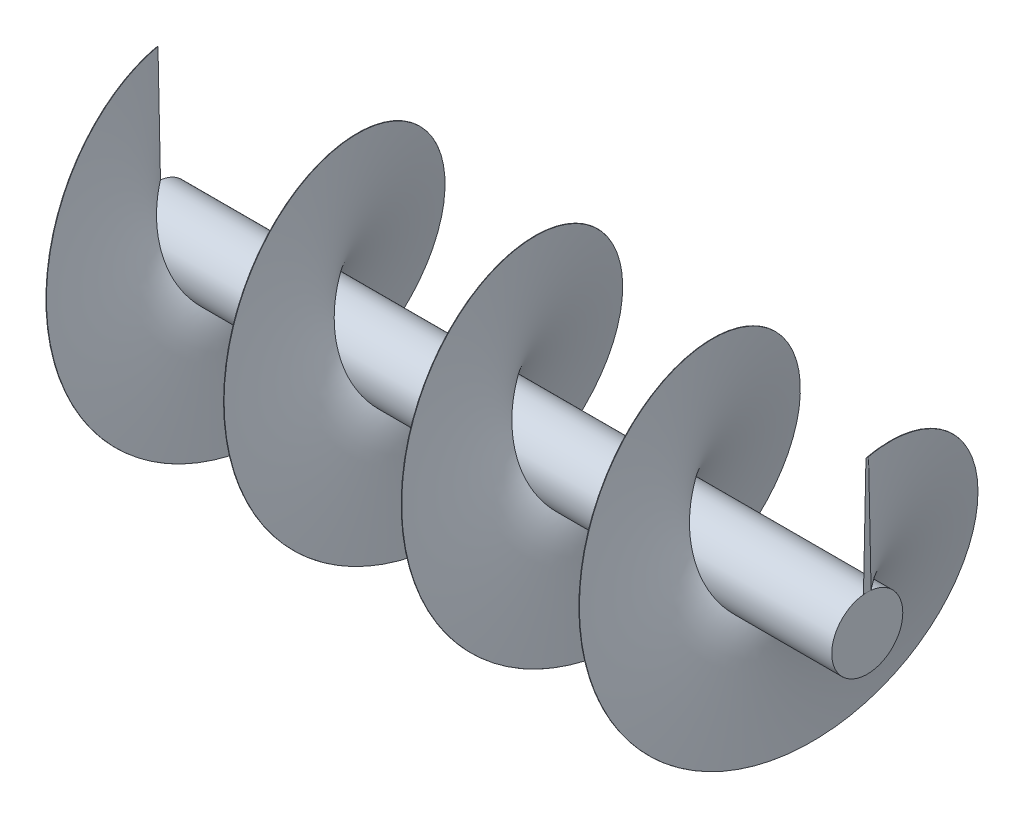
from build123d import *

# Parameters (mm, degrees)
SKETCH1_R           = 10
BOSS_EXTRUDE1_DEPTH = 390
BOSS_EXTRUDE2_START = 330
SKETCH1_3_R         = 10
BOSS_EXTRUDE2_DEPTH = 330
BOSS_EXTRUDE3_START = 330
SKETCH1_4_R         = 35
SKETCH1_4_R_2       = 25
BOSS_EXTRUDE3_DEPTH = 700
BOSS_EXTRUDE4_START = -360
SKETCH1_5_R         = 25
SKETCH1_5_R_2       = 10
BOSS_EXTRUDE4_DEPTH = 10
BOSS_EXTRUDE5_START = 330
SKETCH1_6_R         = 25
SKETCH1_6_R_2       = 10
BOSS_EXTRUDE5_DEPTH = 10
SWEEP1_PITCH        = 175
SWEEP1_HEIGHT       = 700
SWEEP1_RADIUS       = 150
SWEEP1_START_ANGLE  = -90


with BuildPart() as part:
    # Sketch1 → Boss-Extrude1 (new body)
    with BuildSketch(Plane(origin=(0, 0, 0), x_dir=(0, 0, -1), z_dir=(1, 0, 0))):
        Circle(SKETCH1_R)
    extrude(amount=-BOSS_EXTRUDE1_DEPTH)

    # Sketch1_3 → Boss-Extrude2 (add)
    with BuildSketch(Plane(origin=(0, 0, 0), x_dir=(0, 0, -1), z_dir=(1, 0, 0)).offset(BOSS_EXTRUDE2_START)):
        Circle(SKETCH1_3_R)
    extrude(amount=-BOSS_EXTRUDE2_DEPTH)



with BuildPart() as body_2:
    # Sketch1_4 → Boss-Extrude3 (new body)
    with BuildSketch(Plane(origin=(0, 0, 0), x_dir=(0, 0, -1), z_dir=(1, 0, 0)).offset(BOSS_EXTRUDE3_START)):
        Circle(SKETCH1_4_R)
        Circle(SKETCH1_4_R_2, mode=Mode.SUBTRACT)
    extrude(amount=-BOSS_EXTRUDE3_DEPTH)


with BuildPart() as part_1:
    add(part.part)

    add(body_2.part)  # Boss-Extrude4 merges body 2
    # Sketch1_5 → Boss-Extrude4 (add)
    with BuildSketch(Plane(origin=(0, 0, 0), x_dir=(0, 0, -1), z_dir=(1, 0, 0)).offset(BOSS_EXTRUDE4_START)):
        Circle(SKETCH1_5_R)
        Circle(SKETCH1_5_R_2, mode=Mode.SUBTRACT)
    extrude(amount=-BOSS_EXTRUDE4_DEPTH)

    # Sketch1_6 → Boss-Extrude5 (add)
    with BuildSketch(Plane(origin=(0, 0, 0), x_dir=(0, 0, -1), z_dir=(1, 0, 0)).offset(BOSS_EXTRUDE5_START)):
        Circle(SKETCH1_6_R)
        Circle(SKETCH1_6_R_2, mode=Mode.SUBTRACT)
    extrude(amount=-BOSS_EXTRUDE5_DEPTH)


with BuildPart() as body_2_2:
    # Sweep1: sweep along a helix
    with BuildLine() as sweep1_path:
        add(Helix(SWEEP1_PITCH, SWEEP1_HEIGHT, SWEEP1_RADIUS, center=(-370, 0, 0), direction=(1, 0, 0), mode=Mode.PRIVATE).rotate(Axis((-370, 0, 0), (1, 0, 0)), SWEEP1_START_ANGLE))
    # Sketch3 → Sweep1 (sweep)
    with BuildSketch(Plane.ZY.offset(370)):
        with BuildLine():
            Line((-1.308980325, 149.99428846), (-3.75, 34.798527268))
            ThreePointArc((-3.75, 34.798527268), (0, 35), (3.75, 34.798527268))
            Line((3.75, 34.798527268), (1.308980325, 149.99428846))
            ThreePointArc((1.308980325, 149.99428846), (0, 150), (-1.308980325, 149.99428846))
        make_face()
    sweep(path=sweep1_path.line, is_frenet=True)


solid = Compound([part_1.part, body_2_2.part])
